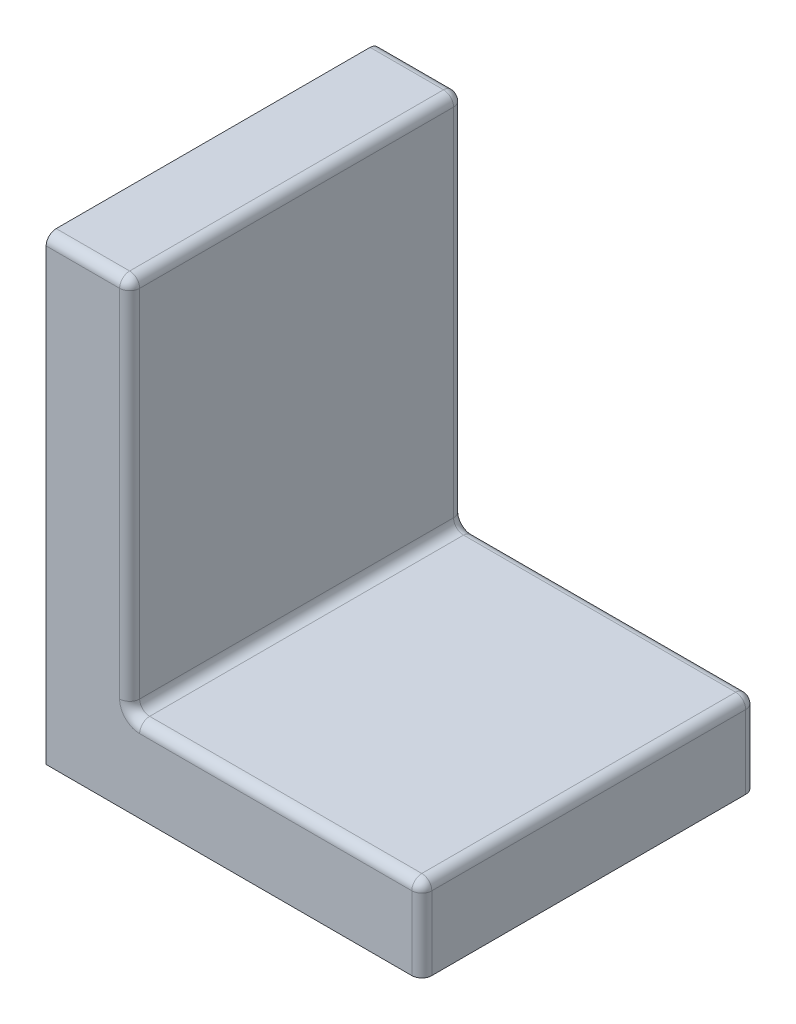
ISO-10303-21;
HEADER;
FILE_DESCRIPTION(('STEP AP214'),'2;1');
FILE_NAME('part.step','',(''),(''),'','','');
FILE_SCHEMA(('AUTOMOTIVE_DESIGN { 1 0 10303 214 1 1 1 1 }'));
ENDSEC;
DATA;
#1=APPLICATION_CONTEXT('core data for automotive mechanical design processes');
#2=APPLICATION_PROTOCOL_DEFINITION('international standard','automotive_design',2000,#1);
#3=PRODUCT_CONTEXT('',#1,'mechanical');
#4=PRODUCT('Part','Part','',(#3));
#5=PRODUCT_RELATED_PRODUCT_CATEGORY('part','',(#4));
#6=PRODUCT_DEFINITION_FORMATION('','',#4);
#7=PRODUCT_DEFINITION_CONTEXT('part definition',#1,'design');
#8=PRODUCT_DEFINITION('design','',#6,#7);
#9=PRODUCT_DEFINITION_SHAPE('','',#8);
#10=(LENGTH_UNIT() NAMED_UNIT(*) SI_UNIT(.MILLI.,.METRE.));
#11=(NAMED_UNIT(*) PLANE_ANGLE_UNIT() SI_UNIT($,.RADIAN.));
#12=(NAMED_UNIT(*) SI_UNIT($,.STERADIAN.) SOLID_ANGLE_UNIT());
#13=UNCERTAINTY_MEASURE_WITH_UNIT(LENGTH_MEASURE(1.E-05),#10,'distance_accuracy_value','');
#14=(GEOMETRIC_REPRESENTATION_CONTEXT(3) GLOBAL_UNCERTAINTY_ASSIGNED_CONTEXT((#13)) GLOBAL_UNIT_ASSIGNED_CONTEXT((#10,
#11,#12)) REPRESENTATION_CONTEXT('',''));
#15=CARTESIAN_POINT('',(0.,0.,0.));
#16=DIRECTION('',(0.,0.,1.));
#17=DIRECTION('',(1.,0.,0.));
#18=AXIS2_PLACEMENT_3D('',#15,#16,#17);
#19=CARTESIAN_POINT('',(12.7,69.85,25.4));
#20=DIRECTION('',(0.,-1.,0.));
#21=DIRECTION('',(0.,0.,-1.));
#22=AXIS2_PLACEMENT_3D('',#19,#20,#21);
#23=PLANE('',#22);
#24=DIRECTION('',(-1.,0.,0.));
#25=VECTOR('',#24,1.);
#26=CARTESIAN_POINT('',(12.7,69.85,23.876));
#27=LINE('',#26,#25);
#28=CARTESIAN_POINT('',(0.,69.85,23.876));
#29=VERTEX_POINT('',#28);
#30=CARTESIAN_POINT('',(11.176,69.85,23.876));
#31=VERTEX_POINT('',#30);
#32=EDGE_CURVE('E196',#29,#31,#27,.F.);
#33=ORIENTED_EDGE('',*,*,#32,.T.);
#34=DIRECTION('',(0.,0.,-1.));
#35=VECTOR('',#34,1.);
#36=CARTESIAN_POINT('',(11.176,69.85,25.4));
#37=LINE('',#36,#35);
#38=CARTESIAN_POINT('',(11.176,69.85,-23.876));
#39=VERTEX_POINT('',#38);
#40=EDGE_CURVE('E11',#31,#39,#37,.T.);
#41=ORIENTED_EDGE('',*,*,#40,.T.);
#42=DIRECTION('',(-1.,0.,0.));
#43=VECTOR('',#42,1.);
#44=CARTESIAN_POINT('',(0.,69.85,-23.876));
#45=LINE('',#44,#43);
#46=CARTESIAN_POINT('',(0.,69.85,-23.876));
#47=VERTEX_POINT('',#46);
#48=EDGE_CURVE('E198',#39,#47,#45,.T.);
#49=ORIENTED_EDGE('',*,*,#48,.T.);
#50=DIRECTION('',(0.,0.,-1.));
#51=VECTOR('',#50,1.);
#52=CARTESIAN_POINT('',(0.,69.85,25.4));
#53=LINE('',#52,#51);
#54=EDGE_CURVE('E158',#29,#47,#53,.T.);
#55=ORIENTED_EDGE('',*,*,#54,.F.);
#56=EDGE_LOOP('',(#33,#41,#49,#55));
#57=FACE_BOUND('',#56,.T.);
#58=ADVANCED_FACE('F32',(#57),#23,.F.);
#59=CARTESIAN_POINT('',(0.,69.85,25.4));
#60=DIRECTION('',(1.,0.,0.));
#61=DIRECTION('',(0.,1.,0.));
#62=AXIS2_PLACEMENT_3D('',#59,#60,#61);
#63=PLANE('',#62);
#64=ORIENTED_EDGE('',*,*,#54,.T.);
#65=CARTESIAN_POINT('',(0.,68.326,-23.876));
#66=DIRECTION('',(1.,0.,0.));
#67=DIRECTION('',(0.,1.,0.));
#68=AXIS2_PLACEMENT_3D('',#65,#66,#67);
#69=CIRCLE('',#68,1.524);
#70=CARTESIAN_POINT('',(0.,68.326,-25.4));
#71=VERTEX_POINT('',#70);
#72=EDGE_CURVE('E145',#47,#71,#69,.F.);
#73=ORIENTED_EDGE('',*,*,#72,.T.);
#74=DIRECTION('',(0.,-1.,0.));
#75=VECTOR('',#74,1.);
#76=CARTESIAN_POINT('',(0.,69.85,-25.4));
#77=LINE('',#76,#75);
#78=CARTESIAN_POINT('',(0.,0.,-25.4));
#79=VERTEX_POINT('',#78);
#80=EDGE_CURVE('E137',#71,#79,#77,.T.);
#81=ORIENTED_EDGE('',*,*,#80,.T.);
#82=DIRECTION('',(0.,0.,-1.));
#83=VECTOR('',#82,1.);
#84=CARTESIAN_POINT('',(0.,0.,25.4));
#85=LINE('',#84,#83);
#86=CARTESIAN_POINT('',(0.,0.,25.4));
#87=VERTEX_POINT('',#86);
#88=EDGE_CURVE('E142',#87,#79,#85,.T.);
#89=ORIENTED_EDGE('',*,*,#88,.F.);
#90=DIRECTION('',(0.,-1.,0.));
#91=VECTOR('',#90,1.);
#92=CARTESIAN_POINT('',(0.,69.85,25.4));
#93=LINE('',#92,#91);
#94=CARTESIAN_POINT('',(0.,68.326,25.4));
#95=VERTEX_POINT('',#94);
#96=EDGE_CURVE('E164',#95,#87,#93,.T.);
#97=ORIENTED_EDGE('',*,*,#96,.F.);
#98=CARTESIAN_POINT('',(0.,68.326,23.876));
#99=DIRECTION('',(1.,0.,0.));
#100=DIRECTION('',(0.,1.,0.));
#101=AXIS2_PLACEMENT_3D('',#98,#99,#100);
#102=CIRCLE('',#101,1.524);
#103=EDGE_CURVE('E200',#95,#29,#102,.F.);
#104=ORIENTED_EDGE('',*,*,#103,.T.);
#105=EDGE_LOOP('',(#64,#73,#81,#89,#97,#104));
#106=FACE_BOUND('',#105,.T.);
#107=ADVANCED_FACE('F140',(#106),#63,.F.);
#108=CARTESIAN_POINT('',(0.,0.,25.4));
#109=DIRECTION('',(0.,1.,0.));
#110=DIRECTION('',(0.,0.,1.));
#111=AXIS2_PLACEMENT_3D('',#108,#109,#110);
#112=PLANE('',#111);
#113=DIRECTION('',(1.,0.,0.));
#114=VECTOR('',#113,1.);
#115=CARTESIAN_POINT('',(0.,0.,-25.4));
#116=LINE('',#115,#114);
#117=CARTESIAN_POINT('',(55.626,0.,-25.4));
#118=VERTEX_POINT('',#117);
#119=EDGE_CURVE('E149',#79,#118,#116,.T.);
#120=ORIENTED_EDGE('',*,*,#119,.T.);
#121=CARTESIAN_POINT('',(55.626,0.,-23.876));
#122=DIRECTION('',(0.,1.,0.));
#123=DIRECTION('',(0.,0.,1.));
#124=AXIS2_PLACEMENT_3D('',#121,#122,#123);
#125=CIRCLE('',#124,1.524);
#126=CARTESIAN_POINT('',(57.15,0.,-23.876));
#127=VERTEX_POINT('',#126);
#128=EDGE_CURVE('E189',#118,#127,#125,.F.);
#129=ORIENTED_EDGE('',*,*,#128,.T.);
#130=DIRECTION('',(0.,0.,-1.));
#131=VECTOR('',#130,1.);
#132=CARTESIAN_POINT('',(57.15,0.,25.4));
#133=LINE('',#132,#131);
#134=CARTESIAN_POINT('',(57.15,0.,23.876));
#135=VERTEX_POINT('',#134);
#136=EDGE_CURVE('E159',#135,#127,#133,.T.);
#137=ORIENTED_EDGE('',*,*,#136,.F.);
#138=CARTESIAN_POINT('',(55.626,0.,23.876));
#139=DIRECTION('',(0.,1.,0.));
#140=DIRECTION('',(0.,0.,1.));
#141=AXIS2_PLACEMENT_3D('',#138,#139,#140);
#142=CIRCLE('',#141,1.524);
#143=CARTESIAN_POINT('',(55.626,0.,25.4));
#144=VERTEX_POINT('',#143);
#145=EDGE_CURVE('E187',#135,#144,#142,.F.);
#146=ORIENTED_EDGE('',*,*,#145,.T.);
#147=DIRECTION('',(1.,0.,0.));
#148=VECTOR('',#147,1.);
#149=CARTESIAN_POINT('',(0.,0.,25.4));
#150=LINE('',#149,#148);
#151=EDGE_CURVE('E157',#87,#144,#150,.T.);
#152=ORIENTED_EDGE('',*,*,#151,.F.);
#153=ORIENTED_EDGE('',*,*,#88,.T.);
#154=EDGE_LOOP('',(#120,#129,#137,#146,#152,#153));
#155=FACE_BOUND('',#154,.T.);
#156=ADVANCED_FACE('F154',(#155),#112,.F.);
#157=CARTESIAN_POINT('',(57.15,0.,25.4));
#158=DIRECTION('',(-1.,0.,0.));
#159=DIRECTION('',(0.,0.,1.));
#160=AXIS2_PLACEMENT_3D('',#157,#158,#159);
#161=PLANE('',#160);
#162=DIRECTION('',(0.,1.,0.));
#163=VECTOR('',#162,1.);
#164=CARTESIAN_POINT('',(57.15,12.7,-23.876));
#165=LINE('',#164,#163);
#166=CARTESIAN_POINT('',(57.15,11.176,-23.876));
#167=VERTEX_POINT('',#166);
#168=EDGE_CURVE('E181',#127,#167,#165,.T.);
#169=ORIENTED_EDGE('',*,*,#168,.T.);
#170=DIRECTION('',(0.,0.,-1.));
#171=VECTOR('',#170,1.);
#172=CARTESIAN_POINT('',(57.15,11.176,25.4));
#173=LINE('',#172,#171);
#174=CARTESIAN_POINT('',(57.15,11.176,23.876));
#175=VERTEX_POINT('',#174);
#176=EDGE_CURVE('E231',#167,#175,#173,.F.);
#177=ORIENTED_EDGE('',*,*,#176,.T.);
#178=DIRECTION('',(0.,1.,0.));
#179=VECTOR('',#178,1.);
#180=CARTESIAN_POINT('',(57.15,0.,23.876));
#181=LINE('',#180,#179);
#182=EDGE_CURVE('E179',#175,#135,#181,.F.);
#183=ORIENTED_EDGE('',*,*,#182,.T.);
#184=ORIENTED_EDGE('',*,*,#136,.T.);
#185=EDGE_LOOP('',(#169,#177,#183,#184));
#186=FACE_BOUND('',#185,.T.);
#187=ADVANCED_FACE('F291',(#186),#161,.F.);
#188=CARTESIAN_POINT('',(57.15,12.7,25.4));
#189=DIRECTION('',(0.,-1.,0.));
#190=DIRECTION('',(1.,0.,0.));
#191=AXIS2_PLACEMENT_3D('',#188,#189,#190);
#192=PLANE('',#191);
#193=DIRECTION('',(0.,0.,-1.));
#194=VECTOR('',#193,1.);
#195=CARTESIAN_POINT('',(14.224,12.7,25.4));
#196=LINE('',#195,#194);
#197=CARTESIAN_POINT('',(14.224,12.7,-23.876));
#198=VERTEX_POINT('',#197);
#199=CARTESIAN_POINT('',(14.224,12.7,23.876));
#200=VERTEX_POINT('',#199);
#201=EDGE_CURVE('E176',#198,#200,#196,.F.);
#202=ORIENTED_EDGE('',*,*,#201,.T.);
#203=DIRECTION('',(-1.,0.,0.));
#204=VECTOR('',#203,1.);
#205=CARTESIAN_POINT('',(57.15,12.7,23.876));
#206=LINE('',#205,#204);
#207=CARTESIAN_POINT('',(55.626,12.7,23.876));
#208=VERTEX_POINT('',#207);
#209=EDGE_CURVE('E227',#200,#208,#206,.F.);
#210=ORIENTED_EDGE('',*,*,#209,.T.);
#211=DIRECTION('',(0.,0.,-1.));
#212=VECTOR('',#211,1.);
#213=CARTESIAN_POINT('',(55.626,12.7,25.4));
#214=LINE('',#213,#212);
#215=CARTESIAN_POINT('',(55.626,12.7,-23.876));
#216=VERTEX_POINT('',#215);
#217=EDGE_CURVE('E225',#208,#216,#214,.T.);
#218=ORIENTED_EDGE('',*,*,#217,.T.);
#219=DIRECTION('',(-1.,0.,0.));
#220=VECTOR('',#219,1.);
#221=CARTESIAN_POINT('',(14.224,12.7,-23.876));
#222=LINE('',#221,#220);
#223=EDGE_CURVE('E223',#216,#198,#222,.T.);
#224=ORIENTED_EDGE('',*,*,#223,.T.);
#225=EDGE_LOOP('',(#202,#210,#218,#224));
#226=FACE_BOUND('',#225,.T.);
#227=ADVANCED_FACE('F348',(#226),#192,.F.);
#228=CARTESIAN_POINT('',(12.7,12.7,25.4));
#229=DIRECTION('',(-1.,0.,0.));
#230=DIRECTION('',(0.,-1.,0.));
#231=AXIS2_PLACEMENT_3D('',#228,#229,#230);
#232=PLANE('',#231);
#233=DIRECTION('',(0.,0.,-1.));
#234=VECTOR('',#233,1.);
#235=CARTESIAN_POINT('',(12.7,68.326,25.4));
#236=LINE('',#235,#234);
#237=CARTESIAN_POINT('',(12.7,68.326,-23.876));
#238=VERTEX_POINT('',#237);
#239=CARTESIAN_POINT('',(12.7,68.326,23.876));
#240=VERTEX_POINT('',#239);
#241=EDGE_CURVE('E212',#238,#240,#236,.F.);
#242=ORIENTED_EDGE('',*,*,#241,.T.);
#243=DIRECTION('',(0.,1.,0.));
#244=VECTOR('',#243,1.);
#245=CARTESIAN_POINT('',(12.7,12.7,23.876));
#246=LINE('',#245,#244);
#247=CARTESIAN_POINT('',(12.7,14.224,23.876));
#248=VERTEX_POINT('',#247);
#249=EDGE_CURVE('E216',#240,#248,#246,.F.);
#250=ORIENTED_EDGE('',*,*,#249,.T.);
#251=DIRECTION('',(0.,0.,-1.));
#252=VECTOR('',#251,1.);
#253=CARTESIAN_POINT('',(12.7,14.224,-25.4));
#254=LINE('',#253,#252);
#255=CARTESIAN_POINT('',(12.7,14.224,-23.876));
#256=VERTEX_POINT('',#255);
#257=EDGE_CURVE('E173',#248,#256,#254,.T.);
#258=ORIENTED_EDGE('',*,*,#257,.T.);
#259=DIRECTION('',(0.,1.,0.));
#260=VECTOR('',#259,1.);
#261=CARTESIAN_POINT('',(12.7,68.326,-23.876));
#262=LINE('',#261,#260);
#263=EDGE_CURVE('E214',#256,#238,#262,.T.);
#264=ORIENTED_EDGE('',*,*,#263,.T.);
#265=EDGE_LOOP('',(#242,#250,#258,#264));
#266=FACE_BOUND('',#265,.T.);
#267=ADVANCED_FACE('F339',(#266),#232,.F.);
#268=CARTESIAN_POINT('',(57.15,69.85,25.4));
#269=DIRECTION('',(0.,0.,-1.));
#270=DIRECTION('',(-1.,0.,0.));
#271=AXIS2_PLACEMENT_3D('',#268,#269,#270);
#272=PLANE('',#271);
#273=CARTESIAN_POINT('',(14.224,14.224,25.4));
#274=DIRECTION('',(0.,0.,-1.));
#275=DIRECTION('',(-1.,0.,0.));
#276=AXIS2_PLACEMENT_3D('',#273,#274,#275);
#277=CIRCLE('',#276,3.048);
#278=CARTESIAN_POINT('',(14.224,11.176,25.4));
#279=VERTEX_POINT('',#278);
#280=CARTESIAN_POINT('',(11.176,14.224,25.4));
#281=VERTEX_POINT('',#280);
#282=EDGE_CURVE('E208',#279,#281,#277,.T.);
#283=ORIENTED_EDGE('',*,*,#282,.T.);
#284=DIRECTION('',(0.,1.,0.));
#285=VECTOR('',#284,1.);
#286=CARTESIAN_POINT('',(11.176,69.85,25.4));
#287=LINE('',#286,#285);
#288=CARTESIAN_POINT('',(11.176,68.326,25.4));
#289=VERTEX_POINT('',#288);
#290=EDGE_CURVE('E210',#281,#289,#287,.T.);
#291=ORIENTED_EDGE('',*,*,#290,.T.);
#292=DIRECTION('',(-1.,0.,0.));
#293=VECTOR('',#292,1.);
#294=CARTESIAN_POINT('',(57.15,68.326,25.4));
#295=LINE('',#294,#293);
#296=EDGE_CURVE('E191',#289,#95,#295,.T.);
#297=ORIENTED_EDGE('',*,*,#296,.T.);
#298=ORIENTED_EDGE('',*,*,#96,.T.);
#299=ORIENTED_EDGE('',*,*,#151,.T.);
#300=DIRECTION('',(0.,1.,0.));
#301=VECTOR('',#300,1.);
#302=CARTESIAN_POINT('',(55.626,69.85,25.4));
#303=LINE('',#302,#301);
#304=CARTESIAN_POINT('',(55.626,11.176,25.4));
#305=VERTEX_POINT('',#304);
#306=EDGE_CURVE('E193',#144,#305,#303,.T.);
#307=ORIENTED_EDGE('',*,*,#306,.T.);
#308=DIRECTION('',(-1.,0.,0.));
#309=VECTOR('',#308,1.);
#310=CARTESIAN_POINT('',(57.15,11.176,25.4));
#311=LINE('',#310,#309);
#312=EDGE_CURVE('E206',#305,#279,#311,.T.);
#313=ORIENTED_EDGE('',*,*,#312,.T.);
#314=EDGE_LOOP('',(#283,#291,#297,#298,#299,#307,#313));
#315=FACE_BOUND('',#314,.T.);
#316=ADVANCED_FACE('F302',(#315),#272,.F.);
#317=CARTESIAN_POINT('',(57.15,69.85,-25.4));
#318=DIRECTION('',(0.,0.,-1.));
#319=DIRECTION('',(-1.,0.,0.));
#320=AXIS2_PLACEMENT_3D('',#317,#318,#319);
#321=PLANE('',#320);
#322=CARTESIAN_POINT('',(14.224,14.224,-25.4));
#323=DIRECTION('',(0.,0.,-1.));
#324=DIRECTION('',(-1.,0.,0.));
#325=AXIS2_PLACEMENT_3D('',#322,#323,#324);
#326=CIRCLE('',#325,3.048);
#327=CARTESIAN_POINT('',(11.176,14.224,-25.4));
#328=VERTEX_POINT('',#327);
#329=CARTESIAN_POINT('',(14.224,11.176,-25.4));
#330=VERTEX_POINT('',#329);
#331=EDGE_CURVE('E52',#328,#330,#326,.F.);
#332=ORIENTED_EDGE('',*,*,#331,.T.);
#333=DIRECTION('',(-1.,0.,0.));
#334=VECTOR('',#333,1.);
#335=CARTESIAN_POINT('',(55.626,11.176,-25.4));
#336=LINE('',#335,#334);
#337=CARTESIAN_POINT('',(55.626,11.176,-25.4));
#338=VERTEX_POINT('',#337);
#339=EDGE_CURVE('E238',#330,#338,#336,.F.);
#340=ORIENTED_EDGE('',*,*,#339,.T.);
#341=DIRECTION('',(0.,1.,0.));
#342=VECTOR('',#341,1.);
#343=CARTESIAN_POINT('',(55.626,0.,-25.4));
#344=LINE('',#343,#342);
#345=EDGE_CURVE('E163',#338,#118,#344,.F.);
#346=ORIENTED_EDGE('',*,*,#345,.T.);
#347=ORIENTED_EDGE('',*,*,#119,.F.);
#348=ORIENTED_EDGE('',*,*,#80,.F.);
#349=DIRECTION('',(-1.,0.,0.));
#350=VECTOR('',#349,1.);
#351=CARTESIAN_POINT('',(12.7,68.326,-25.4));
#352=LINE('',#351,#350);
#353=CARTESIAN_POINT('',(11.176,68.326,-25.4));
#354=VERTEX_POINT('',#353);
#355=EDGE_CURVE('E184',#71,#354,#352,.F.);
#356=ORIENTED_EDGE('',*,*,#355,.T.);
#357=DIRECTION('',(0.,1.,0.));
#358=VECTOR('',#357,1.);
#359=CARTESIAN_POINT('',(11.176,14.224,-25.4));
#360=LINE('',#359,#358);
#361=EDGE_CURVE('E235',#354,#328,#360,.F.);
#362=ORIENTED_EDGE('',*,*,#361,.T.);
#363=EDGE_LOOP('',(#332,#340,#346,#347,#348,#356,#362));
#364=FACE_BOUND('',#363,.T.);
#365=ADVANCED_FACE('F161',(#364),#321,.T.);
#366=CARTESIAN_POINT('',(14.224,14.224,25.4));
#367=DIRECTION('',(0.,0.,1.));
#368=DIRECTION('',(1.,0.,0.));
#369=AXIS2_PLACEMENT_3D('',#366,#367,#368);
#370=CYLINDRICAL_SURFACE('',#369,1.524);
#371=ORIENTED_EDGE('',*,*,#257,.F.);
#372=CARTESIAN_POINT('',(14.224,14.224,23.876));
#373=DIRECTION('',(0.,0.,-1.));
#374=DIRECTION('',(-1.,0.,0.));
#375=AXIS2_PLACEMENT_3D('',#372,#373,#374);
#376=CIRCLE('',#375,1.524);
#377=EDGE_CURVE('E221',#248,#200,#376,.F.);
#378=ORIENTED_EDGE('',*,*,#377,.T.);
#379=ORIENTED_EDGE('',*,*,#201,.F.);
#380=CARTESIAN_POINT('',(14.224,14.224,-23.876));
#381=DIRECTION('',(0.,0.,-1.));
#382=DIRECTION('',(-1.,0.,0.));
#383=AXIS2_PLACEMENT_3D('',#380,#381,#382);
#384=CIRCLE('',#383,1.524);
#385=EDGE_CURVE('E219',#198,#256,#384,.T.);
#386=ORIENTED_EDGE('',*,*,#385,.T.);
#387=EDGE_LOOP('',(#371,#378,#379,#386));
#388=FACE_BOUND('',#387,.T.);
#389=ADVANCED_FACE('F346',(#388),#370,.F.);
#390=CARTESIAN_POINT('',(55.626,0.,-23.876));
#391=DIRECTION('',(0.,-1.,0.));
#392=DIRECTION('',(0.,0.,-1.));
#393=AXIS2_PLACEMENT_3D('',#390,#391,#392);
#394=CYLINDRICAL_SURFACE('',#393,1.524);
#395=ORIENTED_EDGE('',*,*,#345,.F.);
#396=CARTESIAN_POINT('',(55.626,11.176,-23.876));
#397=DIRECTION('',(0.,-1.,0.));
#398=DIRECTION('',(0.,0.,-1.));
#399=AXIS2_PLACEMENT_3D('',#396,#397,#398);
#400=CIRCLE('',#399,1.524);
#401=EDGE_CURVE('E233',#338,#167,#400,.T.);
#402=ORIENTED_EDGE('',*,*,#401,.T.);
#403=ORIENTED_EDGE('',*,*,#168,.F.);
#404=ORIENTED_EDGE('',*,*,#128,.F.);
#405=EDGE_LOOP('',(#395,#402,#403,#404));
#406=FACE_BOUND('',#405,.T.);
#407=ADVANCED_FACE('F289',(#406),#394,.T.);
#408=CARTESIAN_POINT('',(55.626,69.85,23.876));
#409=DIRECTION('',(0.,1.,0.));
#410=DIRECTION('',(0.,0.,1.));
#411=AXIS2_PLACEMENT_3D('',#408,#409,#410);
#412=CYLINDRICAL_SURFACE('',#411,1.524);
#413=ORIENTED_EDGE('',*,*,#182,.F.);
#414=CARTESIAN_POINT('',(55.626,11.176,23.876));
#415=DIRECTION('',(0.,1.,0.));
#416=DIRECTION('',(0.,0.,1.));
#417=AXIS2_PLACEMENT_3D('',#414,#415,#416);
#418=CIRCLE('',#417,1.524);
#419=EDGE_CURVE('E229',#175,#305,#418,.F.);
#420=ORIENTED_EDGE('',*,*,#419,.T.);
#421=ORIENTED_EDGE('',*,*,#306,.F.);
#422=ORIENTED_EDGE('',*,*,#145,.F.);
#423=EDGE_LOOP('',(#413,#420,#421,#422));
#424=FACE_BOUND('',#423,.T.);
#425=ADVANCED_FACE('F297',(#424),#412,.T.);
#426=CARTESIAN_POINT('',(12.7,68.326,-23.876));
#427=DIRECTION('',(1.,0.,0.));
#428=DIRECTION('',(0.,0.,-1.));
#429=AXIS2_PLACEMENT_3D('',#426,#427,#428);
#430=CYLINDRICAL_SURFACE('',#429,1.524);
#431=ORIENTED_EDGE('',*,*,#48,.F.);
#432=CARTESIAN_POINT('',(11.176,68.326,-23.876));
#433=DIRECTION('',(1.,0.,0.));
#434=DIRECTION('',(0.,0.,-1.));
#435=AXIS2_PLACEMENT_3D('',#432,#433,#434);
#436=CIRCLE('',#435,1.524);
#437=EDGE_CURVE('E39',#39,#354,#436,.F.);
#438=ORIENTED_EDGE('',*,*,#437,.T.);
#439=ORIENTED_EDGE('',*,*,#355,.F.);
#440=ORIENTED_EDGE('',*,*,#72,.F.);
#441=EDGE_LOOP('',(#431,#438,#439,#440));
#442=FACE_BOUND('',#441,.T.);
#443=ADVANCED_FACE('F241',(#442),#430,.T.);
#444=CARTESIAN_POINT('',(57.15,68.326,23.876));
#445=DIRECTION('',(-1.,0.,0.));
#446=DIRECTION('',(0.,0.,1.));
#447=AXIS2_PLACEMENT_3D('',#444,#445,#446);
#448=CYLINDRICAL_SURFACE('',#447,1.524);
#449=ORIENTED_EDGE('',*,*,#296,.F.);
#450=CARTESIAN_POINT('',(11.176,68.326,23.876));
#451=DIRECTION('',(-1.,0.,0.));
#452=DIRECTION('',(0.,0.,1.));
#453=AXIS2_PLACEMENT_3D('',#450,#451,#452);
#454=CIRCLE('',#453,1.524);
#455=EDGE_CURVE('E203',#289,#31,#454,.T.);
#456=ORIENTED_EDGE('',*,*,#455,.T.);
#457=ORIENTED_EDGE('',*,*,#32,.F.);
#458=ORIENTED_EDGE('',*,*,#103,.F.);
#459=EDGE_LOOP('',(#449,#456,#457,#458));
#460=FACE_BOUND('',#459,.T.);
#461=ADVANCED_FACE('F323',(#460),#448,.T.);
#462=CARTESIAN_POINT('',(55.626,11.176,-23.876));
#463=DIRECTION('',(0.,0.,1.));
#464=DIRECTION('',(1.,0.,0.));
#465=AXIS2_PLACEMENT_3D('',#462,#463,#464);
#466=SPHERICAL_SURFACE('',#465,1.524);
#467=CARTESIAN_POINT('',(55.626,11.176,-23.876));
#468=DIRECTION('',(0.,0.,1.));
#469=DIRECTION('',(1.,0.,0.));
#470=AXIS2_PLACEMENT_3D('',#467,#468,#469);
#471=CIRCLE('',#470,1.524);
#472=EDGE_CURVE('E274',#167,#216,#471,.T.);
#473=ORIENTED_EDGE('',*,*,#472,.F.);
#474=ORIENTED_EDGE('',*,*,#401,.F.);
#475=CARTESIAN_POINT('',(55.626,11.176,-23.876));
#476=DIRECTION('',(-1.,0.,0.));
#477=DIRECTION('',(0.,0.,1.));
#478=AXIS2_PLACEMENT_3D('',#475,#476,#477);
#479=CIRCLE('',#478,1.524);
#480=EDGE_CURVE('E150',#216,#338,#479,.T.);
#481=ORIENTED_EDGE('',*,*,#480,.F.);
#482=EDGE_LOOP('',(#473,#474,#481));
#483=FACE_BOUND('',#482,.T.);
#484=ADVANCED_FACE('F285',(#483),#466,.T.);
#485=CARTESIAN_POINT('',(57.15,11.176,-23.876));
#486=DIRECTION('',(1.,0.,0.));
#487=DIRECTION('',(0.,1.,0.));
#488=AXIS2_PLACEMENT_3D('',#485,#486,#487);
#489=CYLINDRICAL_SURFACE('',#488,1.524);
#490=ORIENTED_EDGE('',*,*,#480,.T.);
#491=ORIENTED_EDGE('',*,*,#339,.F.);
#492=CARTESIAN_POINT('',(14.224,11.176,-23.876));
#493=DIRECTION('',(-1.,0.,0.));
#494=DIRECTION('',(0.,0.,1.));
#495=AXIS2_PLACEMENT_3D('',#492,#493,#494);
#496=CIRCLE('',#495,1.524);
#497=EDGE_CURVE('E271',#198,#330,#496,.T.);
#498=ORIENTED_EDGE('',*,*,#497,.F.);
#499=ORIENTED_EDGE('',*,*,#223,.F.);
#500=EDGE_LOOP('',(#490,#491,#498,#499));
#501=FACE_BOUND('',#500,.T.);
#502=ADVANCED_FACE('F280',(#501),#489,.T.);
#503=CARTESIAN_POINT('',(55.626,11.176,25.4));
#504=DIRECTION('',(0.,0.,-1.));
#505=DIRECTION('',(-1.,0.,0.));
#506=AXIS2_PLACEMENT_3D('',#503,#504,#505);
#507=CYLINDRICAL_SURFACE('',#506,1.524);
#508=ORIENTED_EDGE('',*,*,#472,.T.);
#509=ORIENTED_EDGE('',*,*,#217,.F.);
#510=CARTESIAN_POINT('',(55.626,11.176,23.876));
#511=DIRECTION('',(0.,0.,1.));
#512=DIRECTION('',(1.,0.,0.));
#513=AXIS2_PLACEMENT_3D('',#510,#511,#512);
#514=CIRCLE('',#513,1.524);
#515=EDGE_CURVE('E268',#175,#208,#514,.T.);
#516=ORIENTED_EDGE('',*,*,#515,.F.);
#517=ORIENTED_EDGE('',*,*,#176,.F.);
#518=EDGE_LOOP('',(#508,#509,#516,#517));
#519=FACE_BOUND('',#518,.T.);
#520=ADVANCED_FACE('F351',(#519),#507,.T.);
#521=CARTESIAN_POINT('',(14.224,14.224,-23.876));
#522=DIRECTION('',(0.,0.,-1.));
#523=DIRECTION('',(-1.,0.,0.));
#524=AXIS2_PLACEMENT_3D('',#521,#522,#523);
#525=TOROIDAL_SURFACE('',#524,3.048,1.524);
#526=ORIENTED_EDGE('',*,*,#497,.T.);
#527=ORIENTED_EDGE('',*,*,#331,.F.);
#528=CARTESIAN_POINT('',(11.176,14.224,-23.876));
#529=DIRECTION('',(0.,1.,0.));
#530=DIRECTION('',(0.,0.,1.));
#531=AXIS2_PLACEMENT_3D('',#528,#529,#530);
#532=CIRCLE('',#531,1.524);
#533=EDGE_CURVE('E254',#256,#328,#532,.T.);
#534=ORIENTED_EDGE('',*,*,#533,.F.);
#535=ORIENTED_EDGE('',*,*,#385,.F.);
#536=EDGE_LOOP('',(#526,#527,#534,#535));
#537=FACE_BOUND('',#536,.T.);
#538=ADVANCED_FACE('F344',(#537),#525,.T.);
#539=CARTESIAN_POINT('',(55.626,11.176,23.876));
#540=DIRECTION('',(0.,0.,1.));
#541=DIRECTION('',(1.,0.,0.));
#542=AXIS2_PLACEMENT_3D('',#539,#540,#541);
#543=SPHERICAL_SURFACE('',#542,1.524);
#544=ORIENTED_EDGE('',*,*,#419,.F.);
#545=ORIENTED_EDGE('',*,*,#515,.T.);
#546=CARTESIAN_POINT('',(55.626,11.176,23.876));
#547=DIRECTION('',(-1.,0.,0.));
#548=DIRECTION('',(0.,0.,1.));
#549=AXIS2_PLACEMENT_3D('',#546,#547,#548);
#550=CIRCLE('',#549,1.524);
#551=EDGE_CURVE('E258',#305,#208,#550,.T.);
#552=ORIENTED_EDGE('',*,*,#551,.F.);
#553=EDGE_LOOP('',(#544,#545,#552));
#554=FACE_BOUND('',#553,.T.);
#555=ADVANCED_FACE('F306',(#554),#543,.T.);
#556=CARTESIAN_POINT('',(11.176,12.7,-23.876));
#557=DIRECTION('',(0.,-1.,0.));
#558=DIRECTION('',(1.,0.,0.));
#559=AXIS2_PLACEMENT_3D('',#556,#557,#558);
#560=CYLINDRICAL_SURFACE('',#559,1.524);
#561=ORIENTED_EDGE('',*,*,#533,.T.);
#562=ORIENTED_EDGE('',*,*,#361,.F.);
#563=CARTESIAN_POINT('',(11.176,68.326,-23.876));
#564=DIRECTION('',(0.,1.,0.));
#565=DIRECTION('',(0.,0.,1.));
#566=AXIS2_PLACEMENT_3D('',#563,#564,#565);
#567=CIRCLE('',#566,1.524);
#568=EDGE_CURVE('E252',#238,#354,#567,.T.);
#569=ORIENTED_EDGE('',*,*,#568,.F.);
#570=ORIENTED_EDGE('',*,*,#263,.F.);
#571=EDGE_LOOP('',(#561,#562,#569,#570));
#572=FACE_BOUND('',#571,.T.);
#573=ADVANCED_FACE('F250',(#572),#560,.T.);
#574=CARTESIAN_POINT('',(57.15,11.176,23.876));
#575=DIRECTION('',(-1.,0.,0.));
#576=DIRECTION('',(0.,-1.,0.));
#577=AXIS2_PLACEMENT_3D('',#574,#575,#576);
#578=CYLINDRICAL_SURFACE('',#577,1.524);
#579=ORIENTED_EDGE('',*,*,#551,.T.);
#580=ORIENTED_EDGE('',*,*,#209,.F.);
#581=CARTESIAN_POINT('',(14.224,11.176,23.876));
#582=DIRECTION('',(-1.,0.,0.));
#583=DIRECTION('',(0.,0.,1.));
#584=AXIS2_PLACEMENT_3D('',#581,#582,#583);
#585=CIRCLE('',#584,1.524);
#586=EDGE_CURVE('E259',#279,#200,#585,.T.);
#587=ORIENTED_EDGE('',*,*,#586,.F.);
#588=ORIENTED_EDGE('',*,*,#312,.F.);
#589=EDGE_LOOP('',(#579,#580,#587,#588));
#590=FACE_BOUND('',#589,.T.);
#591=ADVANCED_FACE('F309',(#590),#578,.T.);
#592=CARTESIAN_POINT('',(11.176,68.326,-23.876));
#593=DIRECTION('',(0.,0.,1.));
#594=DIRECTION('',(1.,0.,0.));
#595=AXIS2_PLACEMENT_3D('',#592,#593,#594);
#596=SPHERICAL_SURFACE('',#595,1.524);
#597=ORIENTED_EDGE('',*,*,#568,.T.);
#598=ORIENTED_EDGE('',*,*,#437,.F.);
#599=CARTESIAN_POINT('',(11.176,68.326,-23.876));
#600=DIRECTION('',(0.,0.,1.));
#601=DIRECTION('',(1.,0.,0.));
#602=AXIS2_PLACEMENT_3D('',#599,#600,#601);
#603=CIRCLE('',#602,1.524);
#604=EDGE_CURVE('E256',#238,#39,#603,.T.);
#605=ORIENTED_EDGE('',*,*,#604,.F.);
#606=EDGE_LOOP('',(#597,#598,#605));
#607=FACE_BOUND('',#606,.T.);
#608=ADVANCED_FACE('F255',(#607),#596,.T.);
#609=CARTESIAN_POINT('',(14.224,14.224,23.876));
#610=DIRECTION('',(0.,0.,-1.));
#611=DIRECTION('',(-1.,0.,0.));
#612=AXIS2_PLACEMENT_3D('',#609,#610,#611);
#613=TOROIDAL_SURFACE('',#612,3.048,1.524);
#614=ORIENTED_EDGE('',*,*,#586,.T.);
#615=ORIENTED_EDGE('',*,*,#377,.F.);
#616=CARTESIAN_POINT('',(11.176,14.224,23.876));
#617=DIRECTION('',(0.,1.,0.));
#618=DIRECTION('',(0.,0.,1.));
#619=AXIS2_PLACEMENT_3D('',#616,#617,#618);
#620=CIRCLE('',#619,1.524);
#621=EDGE_CURVE('E315',#281,#248,#620,.T.);
#622=ORIENTED_EDGE('',*,*,#621,.F.);
#623=ORIENTED_EDGE('',*,*,#282,.F.);
#624=EDGE_LOOP('',(#614,#615,#622,#623));
#625=FACE_BOUND('',#624,.T.);
#626=ADVANCED_FACE('F314',(#625),#613,.T.);
#627=CARTESIAN_POINT('',(11.176,68.326,25.4));
#628=DIRECTION('',(0.,0.,-1.));
#629=DIRECTION('',(-1.,0.,0.));
#630=AXIS2_PLACEMENT_3D('',#627,#628,#629);
#631=CYLINDRICAL_SURFACE('',#630,1.524);
#632=ORIENTED_EDGE('',*,*,#604,.T.);
#633=ORIENTED_EDGE('',*,*,#40,.F.);
#634=CARTESIAN_POINT('',(11.176,68.326,23.876));
#635=DIRECTION('',(0.,0.,1.));
#636=DIRECTION('',(1.,0.,0.));
#637=AXIS2_PLACEMENT_3D('',#634,#635,#636);
#638=CIRCLE('',#637,1.524);
#639=EDGE_CURVE('E330',#240,#31,#638,.T.);
#640=ORIENTED_EDGE('',*,*,#639,.F.);
#641=ORIENTED_EDGE('',*,*,#241,.F.);
#642=EDGE_LOOP('',(#632,#633,#640,#641));
#643=FACE_BOUND('',#642,.T.);
#644=ADVANCED_FACE('F337',(#643),#631,.T.);
#645=CARTESIAN_POINT('',(11.176,69.85,23.876));
#646=DIRECTION('',(0.,1.,0.));
#647=DIRECTION('',(-1.,0.,0.));
#648=AXIS2_PLACEMENT_3D('',#645,#646,#647);
#649=CYLINDRICAL_SURFACE('',#648,1.524);
#650=ORIENTED_EDGE('',*,*,#621,.T.);
#651=ORIENTED_EDGE('',*,*,#249,.F.);
#652=CARTESIAN_POINT('',(11.176,68.326,23.876));
#653=DIRECTION('',(0.,1.,0.));
#654=DIRECTION('',(0.,0.,1.));
#655=AXIS2_PLACEMENT_3D('',#652,#653,#654);
#656=CIRCLE('',#655,1.524);
#657=EDGE_CURVE('E328',#289,#240,#656,.T.);
#658=ORIENTED_EDGE('',*,*,#657,.F.);
#659=ORIENTED_EDGE('',*,*,#290,.F.);
#660=EDGE_LOOP('',(#650,#651,#658,#659));
#661=FACE_BOUND('',#660,.T.);
#662=ADVANCED_FACE('F332',(#661),#649,.T.);
#663=CARTESIAN_POINT('',(11.176,68.326,23.876));
#664=DIRECTION('',(0.,0.,1.));
#665=DIRECTION('',(1.,0.,0.));
#666=AXIS2_PLACEMENT_3D('',#663,#664,#665);
#667=SPHERICAL_SURFACE('',#666,1.524);
#668=ORIENTED_EDGE('',*,*,#639,.T.);
#669=ORIENTED_EDGE('',*,*,#455,.F.);
#670=ORIENTED_EDGE('',*,*,#657,.T.);
#671=EDGE_LOOP('',(#668,#669,#670));
#672=FACE_BOUND('',#671,.T.);
#673=ADVANCED_FACE('F327',(#672),#667,.T.);
#674=CLOSED_SHELL('',(#58,#107,#156,#187,#227,#267,#316,#365,#389,#407,#425,#443,#461,#484,#502,
#520,#538,#555,#573,#591,#608,#626,#644,#662,#673));
#675=MANIFOLD_SOLID_BREP('B2',#674);
#676=ADVANCED_BREP_SHAPE_REPRESENTATION('',(#18,#675),#14);
#677=SHAPE_DEFINITION_REPRESENTATION(#9,#676);
ENDSEC;
END-ISO-10303-21;
